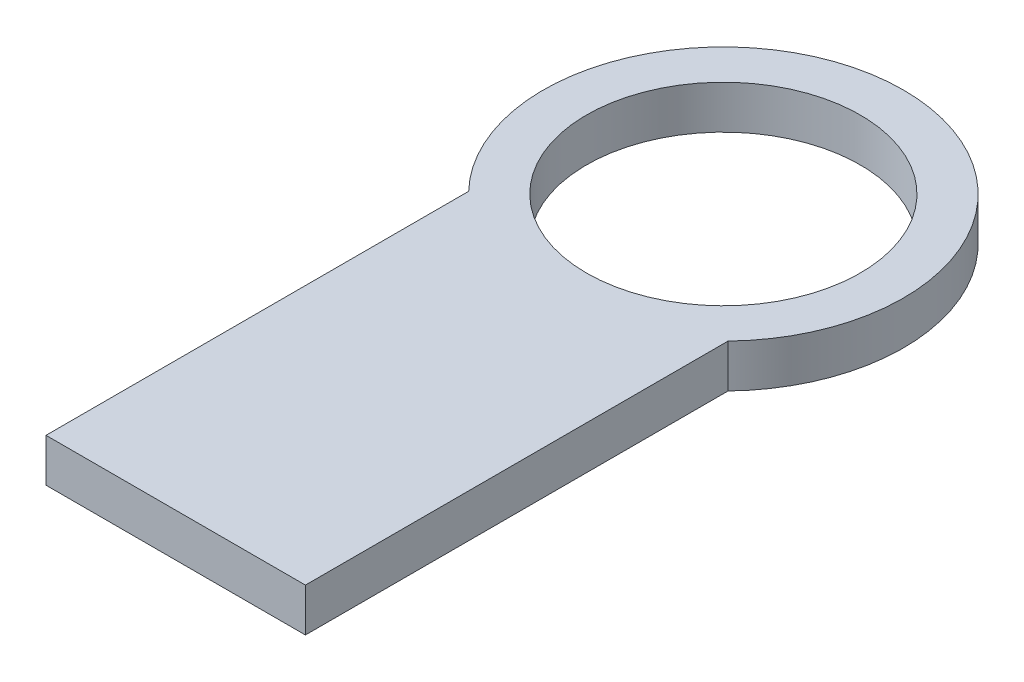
ISO-10303-21;
HEADER;
FILE_DESCRIPTION(('STEP AP214'),'2;1');
FILE_NAME('part.step','',(''),(''),'','','');
FILE_SCHEMA(('AUTOMOTIVE_DESIGN { 1 0 10303 214 1 1 1 1 }'));
ENDSEC;
DATA;
#1=APPLICATION_CONTEXT('core data for automotive mechanical design processes');
#2=APPLICATION_PROTOCOL_DEFINITION('international standard','automotive_design',2000,#1);
#3=PRODUCT_CONTEXT('',#1,'mechanical');
#4=PRODUCT('Part','Part','',(#3));
#5=PRODUCT_RELATED_PRODUCT_CATEGORY('part','',(#4));
#6=PRODUCT_DEFINITION_FORMATION('','',#4);
#7=PRODUCT_DEFINITION_CONTEXT('part definition',#1,'design');
#8=PRODUCT_DEFINITION('design','',#6,#7);
#9=PRODUCT_DEFINITION_SHAPE('','',#8);
#10=(LENGTH_UNIT() NAMED_UNIT(*) SI_UNIT(.MILLI.,.METRE.));
#11=(NAMED_UNIT(*) PLANE_ANGLE_UNIT() SI_UNIT($,.RADIAN.));
#12=(NAMED_UNIT(*) SI_UNIT($,.STERADIAN.) SOLID_ANGLE_UNIT());
#13=UNCERTAINTY_MEASURE_WITH_UNIT(LENGTH_MEASURE(1.E-05),#10,'distance_accuracy_value','');
#14=(GEOMETRIC_REPRESENTATION_CONTEXT(3) GLOBAL_UNCERTAINTY_ASSIGNED_CONTEXT((#13)) GLOBAL_UNIT_ASSIGNED_CONTEXT((#10,
#11,#12)) REPRESENTATION_CONTEXT('',''));
#15=CARTESIAN_POINT('',(0.,0.,0.));
#16=DIRECTION('',(0.,0.,1.));
#17=DIRECTION('',(1.,0.,0.));
#18=AXIS2_PLACEMENT_3D('',#15,#16,#17);
#19=CARTESIAN_POINT('',(0.,3.,-38.));
#20=DIRECTION('',(0.,1.,0.));
#21=DIRECTION('',(0.,0.,1.));
#22=AXIS2_PLACEMENT_3D('',#19,#20,#21);
#23=PLANE('',#22);
#24=DIRECTION('',(1.,0.,0.));
#25=VECTOR('',#24,1.);
#26=CARTESIAN_POINT('',(-9.,3.,0.));
#27=LINE('',#26,#25);
#28=CARTESIAN_POINT('',(-9.,3.,0.));
#29=VERTEX_POINT('',#28);
#30=CARTESIAN_POINT('',(9.,3.,0.));
#31=VERTEX_POINT('',#30);
#32=EDGE_CURVE('E82',#29,#31,#27,.T.);
#33=ORIENTED_EDGE('',*,*,#32,.T.);
#34=DIRECTION('',(0.,0.,-1.));
#35=VECTOR('',#34,1.);
#36=CARTESIAN_POINT('',(9.,3.,0.));
#37=LINE('',#36,#35);
#38=CARTESIAN_POINT('',(9.,3.,-29.3253242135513));
#39=VERTEX_POINT('',#38);
#40=EDGE_CURVE('E77',#31,#39,#37,.T.);
#41=ORIENTED_EDGE('',*,*,#40,.T.);
#42=CARTESIAN_POINT('',(0.,3.,-38.));
#43=DIRECTION('',(0.,1.,0.));
#44=DIRECTION('',(0.,0.,1.));
#45=AXIS2_PLACEMENT_3D('',#42,#43,#44);
#46=CIRCLE('',#45,12.5);
#47=CARTESIAN_POINT('',(-9.,3.,-29.3253242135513));
#48=VERTEX_POINT('',#47);
#49=EDGE_CURVE('E80',#39,#48,#46,.T.);
#50=ORIENTED_EDGE('',*,*,#49,.T.);
#51=DIRECTION('',(0.,0.,1.));
#52=VECTOR('',#51,1.);
#53=CARTESIAN_POINT('',(-9.,3.,0.));
#54=LINE('',#53,#52);
#55=EDGE_CURVE('E47',#48,#29,#54,.T.);
#56=ORIENTED_EDGE('',*,*,#55,.T.);
#57=EDGE_LOOP('',(#33,#41,#50,#56));
#58=FACE_BOUND('',#57,.T.);
#59=CARTESIAN_POINT('',(0.,3.,-38.));
#60=DIRECTION('',(0.,1.,0.));
#61=DIRECTION('',(0.,0.,1.));
#62=AXIS2_PLACEMENT_3D('',#59,#60,#61);
#63=CIRCLE('',#62,9.5);
#64=CARTESIAN_POINT('',(0.,3.,-28.5));
#65=VERTEX_POINT('',#64);
#66=EDGE_CURVE('E97',#65,#65,#63,.T.);
#67=ORIENTED_EDGE('',*,*,#66,.F.);
#68=EDGE_LOOP('',(#67));
#69=FACE_BOUND('',#68,.T.);
#70=ADVANCED_FACE('F30',(#58,#69),#23,.T.);
#71=CARTESIAN_POINT('',(0.,0.,-38.));
#72=DIRECTION('',(0.,1.,0.));
#73=DIRECTION('',(0.,0.,1.));
#74=AXIS2_PLACEMENT_3D('',#71,#72,#73);
#75=PLANE('',#74);
#76=DIRECTION('',(1.,0.,0.));
#77=VECTOR('',#76,1.);
#78=CARTESIAN_POINT('',(-9.,0.,0.));
#79=LINE('',#78,#77);
#80=CARTESIAN_POINT('',(-9.,0.,0.));
#81=VERTEX_POINT('',#80);
#82=CARTESIAN_POINT('',(9.,0.,0.));
#83=VERTEX_POINT('',#82);
#84=EDGE_CURVE('E94',#81,#83,#79,.T.);
#85=ORIENTED_EDGE('',*,*,#84,.F.);
#86=DIRECTION('',(0.,0.,1.));
#87=VECTOR('',#86,1.);
#88=CARTESIAN_POINT('',(-9.,0.,0.));
#89=LINE('',#88,#87);
#90=CARTESIAN_POINT('',(-9.,0.,-29.3253242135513));
#91=VERTEX_POINT('',#90);
#92=EDGE_CURVE('E70',#91,#81,#89,.T.);
#93=ORIENTED_EDGE('',*,*,#92,.F.);
#94=CARTESIAN_POINT('',(0.,0.,-38.));
#95=DIRECTION('',(0.,1.,0.));
#96=DIRECTION('',(0.,0.,1.));
#97=AXIS2_PLACEMENT_3D('',#94,#95,#96);
#98=CIRCLE('',#97,12.5);
#99=CARTESIAN_POINT('',(9.,0.,-29.3253242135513));
#100=VERTEX_POINT('',#99);
#101=EDGE_CURVE('E64',#100,#91,#98,.T.);
#102=ORIENTED_EDGE('',*,*,#101,.F.);
#103=DIRECTION('',(0.,0.,-1.));
#104=VECTOR('',#103,1.);
#105=CARTESIAN_POINT('',(9.,0.,0.));
#106=LINE('',#105,#104);
#107=EDGE_CURVE('E86',#83,#100,#106,.T.);
#108=ORIENTED_EDGE('',*,*,#107,.F.);
#109=EDGE_LOOP('',(#85,#93,#102,#108));
#110=FACE_BOUND('',#109,.T.);
#111=CARTESIAN_POINT('',(0.,0.,-38.));
#112=DIRECTION('',(0.,1.,0.));
#113=DIRECTION('',(0.,0.,1.));
#114=AXIS2_PLACEMENT_3D('',#111,#112,#113);
#115=CIRCLE('',#114,9.5);
#116=CARTESIAN_POINT('',(0.,0.,-28.5));
#117=VERTEX_POINT('',#116);
#118=EDGE_CURVE('E109',#117,#117,#115,.T.);
#119=ORIENTED_EDGE('',*,*,#118,.T.);
#120=EDGE_LOOP('',(#119));
#121=FACE_BOUND('',#120,.T.);
#122=ADVANCED_FACE('F105',(#110,#121),#75,.F.);
#123=CARTESIAN_POINT('',(-9.,3.,0.));
#124=DIRECTION('',(0.,0.,-1.));
#125=DIRECTION('',(-1.,0.,0.));
#126=AXIS2_PLACEMENT_3D('',#123,#124,#125);
#127=PLANE('',#126);
#128=ORIENTED_EDGE('',*,*,#84,.T.);
#129=DIRECTION('',(0.,-1.,0.));
#130=VECTOR('',#129,1.);
#131=CARTESIAN_POINT('',(9.,3.,0.));
#132=LINE('',#131,#130);
#133=EDGE_CURVE('E11',#31,#83,#132,.T.);
#134=ORIENTED_EDGE('',*,*,#133,.F.);
#135=ORIENTED_EDGE('',*,*,#32,.F.);
#136=DIRECTION('',(0.,-1.,0.));
#137=VECTOR('',#136,1.);
#138=CARTESIAN_POINT('',(-9.,3.,0.));
#139=LINE('',#138,#137);
#140=EDGE_CURVE('E90',#29,#81,#139,.T.);
#141=ORIENTED_EDGE('',*,*,#140,.T.);
#142=EDGE_LOOP('',(#128,#134,#135,#141));
#143=FACE_BOUND('',#142,.T.);
#144=ADVANCED_FACE('F32',(#143),#127,.F.);
#145=CARTESIAN_POINT('',(9.,3.,0.));
#146=DIRECTION('',(-1.,0.,0.));
#147=DIRECTION('',(0.,0.,1.));
#148=AXIS2_PLACEMENT_3D('',#145,#146,#147);
#149=PLANE('',#148);
#150=ORIENTED_EDGE('',*,*,#107,.T.);
#151=DIRECTION('',(0.,-1.,0.));
#152=VECTOR('',#151,1.);
#153=CARTESIAN_POINT('',(9.,3.,-29.3253242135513));
#154=LINE('',#153,#152);
#155=EDGE_CURVE('E39',#39,#100,#154,.T.);
#156=ORIENTED_EDGE('',*,*,#155,.F.);
#157=ORIENTED_EDGE('',*,*,#40,.F.);
#158=ORIENTED_EDGE('',*,*,#133,.T.);
#159=EDGE_LOOP('',(#150,#156,#157,#158));
#160=FACE_BOUND('',#159,.T.);
#161=ADVANCED_FACE('F85',(#160),#149,.F.);
#162=CARTESIAN_POINT('',(0.,3.,-38.));
#163=DIRECTION('',(0.,-1.,0.));
#164=DIRECTION('',(0.,0.,-1.));
#165=AXIS2_PLACEMENT_3D('',#162,#163,#164);
#166=CYLINDRICAL_SURFACE('',#165,12.5);
#167=ORIENTED_EDGE('',*,*,#101,.T.);
#168=DIRECTION('',(0.,-1.,0.));
#169=VECTOR('',#168,1.);
#170=CARTESIAN_POINT('',(-9.,3.,-29.3253242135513));
#171=LINE('',#170,#169);
#172=EDGE_CURVE('E87',#48,#91,#171,.T.);
#173=ORIENTED_EDGE('',*,*,#172,.F.);
#174=ORIENTED_EDGE('',*,*,#49,.F.);
#175=ORIENTED_EDGE('',*,*,#155,.T.);
#176=EDGE_LOOP('',(#167,#173,#174,#175));
#177=FACE_BOUND('',#176,.T.);
#178=ADVANCED_FACE('F88',(#177),#166,.T.);
#179=CARTESIAN_POINT('',(-9.,3.,0.));
#180=DIRECTION('',(1.,0.,0.));
#181=DIRECTION('',(0.,0.,-1.));
#182=AXIS2_PLACEMENT_3D('',#179,#180,#181);
#183=PLANE('',#182);
#184=ORIENTED_EDGE('',*,*,#92,.T.);
#185=ORIENTED_EDGE('',*,*,#140,.F.);
#186=ORIENTED_EDGE('',*,*,#55,.F.);
#187=ORIENTED_EDGE('',*,*,#172,.T.);
#188=EDGE_LOOP('',(#184,#185,#186,#187));
#189=FACE_BOUND('',#188,.T.);
#190=ADVANCED_FACE('F102',(#189),#183,.F.);
#191=CARTESIAN_POINT('',(0.,3.,-38.));
#192=DIRECTION('',(0.,-1.,0.));
#193=DIRECTION('',(0.,0.,-1.));
#194=AXIS2_PLACEMENT_3D('',#191,#192,#193);
#195=CYLINDRICAL_SURFACE('',#194,9.5);
#196=ORIENTED_EDGE('',*,*,#66,.T.);
#197=EDGE_LOOP('',(#196));
#198=FACE_BOUND('',#197,.T.);
#199=ORIENTED_EDGE('',*,*,#118,.F.);
#200=EDGE_LOOP('',(#199));
#201=FACE_BOUND('',#200,.T.);
#202=ADVANCED_FACE('F115',(#198,#201),#195,.F.);
#203=CLOSED_SHELL('',(#70,#122,#144,#161,#178,#190,#202));
#204=MANIFOLD_SOLID_BREP('B2',#203);
#205=ADVANCED_BREP_SHAPE_REPRESENTATION('',(#18,#204),#14);
#206=SHAPE_DEFINITION_REPRESENTATION(#9,#205);
ENDSEC;
END-ISO-10303-21;
